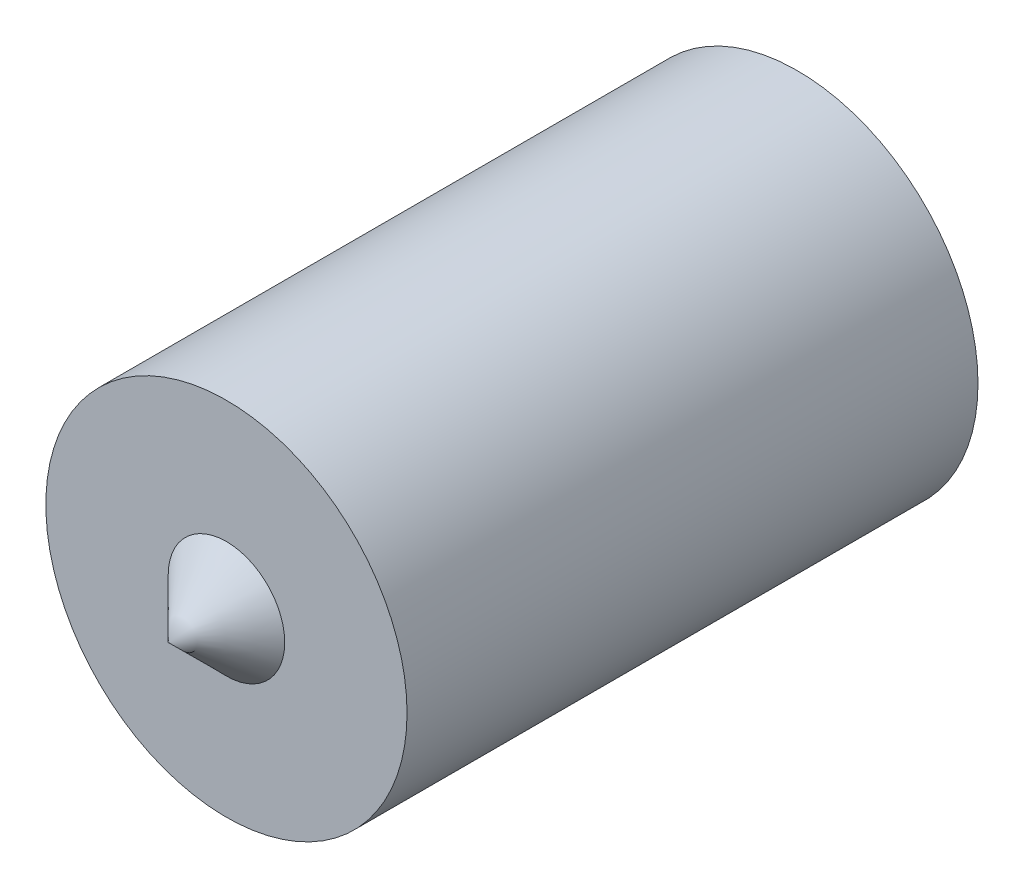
ISO-10303-21;
HEADER;
FILE_DESCRIPTION(('STEP AP214'),'2;1');
FILE_NAME('part.step','',(''),(''),'','','');
FILE_SCHEMA(('AUTOMOTIVE_DESIGN { 1 0 10303 214 1 1 1 1 }'));
ENDSEC;
DATA;
#1=APPLICATION_CONTEXT('core data for automotive mechanical design processes');
#2=APPLICATION_PROTOCOL_DEFINITION('international standard','automotive_design',2000,#1);
#3=PRODUCT_CONTEXT('',#1,'mechanical');
#4=PRODUCT('Part','Part','',(#3));
#5=PRODUCT_RELATED_PRODUCT_CATEGORY('part','',(#4));
#6=PRODUCT_DEFINITION_FORMATION('','',#4);
#7=PRODUCT_DEFINITION_CONTEXT('part definition',#1,'design');
#8=PRODUCT_DEFINITION('design','',#6,#7);
#9=PRODUCT_DEFINITION_SHAPE('','',#8);
#10=(LENGTH_UNIT() NAMED_UNIT(*) SI_UNIT(.MILLI.,.METRE.));
#11=(NAMED_UNIT(*) PLANE_ANGLE_UNIT() SI_UNIT($,.RADIAN.));
#12=(NAMED_UNIT(*) SI_UNIT($,.STERADIAN.) SOLID_ANGLE_UNIT());
#13=UNCERTAINTY_MEASURE_WITH_UNIT(LENGTH_MEASURE(1.E-05),#10,'distance_accuracy_value','');
#14=(GEOMETRIC_REPRESENTATION_CONTEXT(3) GLOBAL_UNCERTAINTY_ASSIGNED_CONTEXT((#13)) GLOBAL_UNIT_ASSIGNED_CONTEXT((#10,
#11,#12)) REPRESENTATION_CONTEXT('',''));
#15=CARTESIAN_POINT('',(0.,0.,0.));
#16=DIRECTION('',(0.,0.,1.));
#17=DIRECTION('',(1.,0.,0.));
#18=AXIS2_PLACEMENT_3D('',#15,#16,#17);
#19=CARTESIAN_POINT('',(0.,0.,-0.635000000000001));
#20=DIRECTION('',(0.,0.,-1.));
#21=DIRECTION('',(-1.,0.,0.));
#22=AXIS2_PLACEMENT_3D('',#19,#20,#21);
#23=CONICAL_SURFACE('',#22,0.634999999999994,0.785398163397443);
#24=CARTESIAN_POINT('',(0.,0.,0.));
#25=VERTEX_POINT('',#24);
#26=VERTEX_LOOP('',#25);
#27=FACE_BOUND('',#26,.T.);
#28=CARTESIAN_POINT('',(0.,0.,-0.635000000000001));
#29=DIRECTION('',(0.,0.,1.));
#30=DIRECTION('',(1.,0.,0.));
#31=AXIS2_PLACEMENT_3D('',#28,#29,#30);
#32=CIRCLE('',#31,0.634999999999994);
#33=CARTESIAN_POINT('',(0.634999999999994,0.,-0.635000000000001));
#34=VERTEX_POINT('',#33);
#35=EDGE_CURVE('E53',#34,#34,#32,.T.);
#36=ORIENTED_EDGE('',*,*,#35,.T.);
#37=EDGE_LOOP('',(#36));
#38=FACE_BOUND('',#37,.T.);
#39=ADVANCED_FACE('F35',(#27,#38),#23,.T.);
#40=CARTESIAN_POINT('',(0.,0.,-1.11545644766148));
#41=DIRECTION('',(0.,0.,-1.));
#42=DIRECTION('',(-1.,0.,0.));
#43=AXIS2_PLACEMENT_3D('',#40,#41,#42);
#44=CONICAL_SURFACE('',#43,0.,1.0471975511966);
#45=CARTESIAN_POINT('',(0.,0.,-2.032));
#46=DIRECTION('',(0.,0.,1.));
#47=DIRECTION('',(1.,0.,0.));
#48=AXIS2_PLACEMENT_3D('',#45,#46,#47);
#49=CIRCLE('',#48,1.5875);
#50=CARTESIAN_POINT('',(1.5875,0.,-2.032));
#51=VERTEX_POINT('',#50);
#52=EDGE_CURVE('E11',#51,#51,#49,.T.);
#53=ORIENTED_EDGE('',*,*,#52,.F.);
#54=EDGE_LOOP('',(#53));
#55=FACE_BOUND('',#54,.T.);
#56=CARTESIAN_POINT('',(0.,0.,-1.11545644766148));
#57=VERTEX_POINT('',#56);
#58=VERTEX_LOOP('',#57);
#59=FACE_BOUND('',#58,.T.);
#60=ADVANCED_FACE('F50',(#55,#59),#44,.F.);
#61=CARTESIAN_POINT('',(0.,0.,0.));
#62=DIRECTION('',(0.,0.,1.));
#63=DIRECTION('',(1.,0.,0.));
#64=AXIS2_PLACEMENT_3D('',#61,#62,#63);
#65=CYLINDRICAL_SURFACE('',#64,1.5875);
#66=CARTESIAN_POINT('',(0.,0.,-6.858));
#67=DIRECTION('',(0.,0.,1.));
#68=DIRECTION('',(1.,0.,0.));
#69=AXIS2_PLACEMENT_3D('',#66,#67,#68);
#70=CIRCLE('',#69,1.5875);
#71=CARTESIAN_POINT('',(1.5875,0.,-6.858));
#72=VERTEX_POINT('',#71);
#73=EDGE_CURVE('E42',#72,#72,#70,.T.);
#74=ORIENTED_EDGE('',*,*,#73,.F.);
#75=EDGE_LOOP('',(#74));
#76=FACE_BOUND('',#75,.T.);
#77=ORIENTED_EDGE('',*,*,#52,.T.);
#78=EDGE_LOOP('',(#77));
#79=FACE_BOUND('',#78,.T.);
#80=ADVANCED_FACE('F67',(#76,#79),#65,.F.);
#81=CARTESIAN_POINT('',(0.,1.5875,-6.858));
#82=DIRECTION('',(0.,0.,1.));
#83=DIRECTION('',(1.,0.,0.));
#84=AXIS2_PLACEMENT_3D('',#81,#82,#83);
#85=PLANE('',#84);
#86=CARTESIAN_POINT('',(0.,0.,-6.858));
#87=DIRECTION('',(0.,0.,1.));
#88=DIRECTION('',(1.,0.,0.));
#89=AXIS2_PLACEMENT_3D('',#86,#87,#88);
#90=CIRCLE('',#89,1.9685);
#91=CARTESIAN_POINT('',(1.9685,0.,-6.858));
#92=VERTEX_POINT('',#91);
#93=EDGE_CURVE('E58',#92,#92,#90,.T.);
#94=ORIENTED_EDGE('',*,*,#93,.F.);
#95=EDGE_LOOP('',(#94));
#96=FACE_BOUND('',#95,.T.);
#97=ORIENTED_EDGE('',*,*,#73,.T.);
#98=EDGE_LOOP('',(#97));
#99=FACE_BOUND('',#98,.T.);
#100=ADVANCED_FACE('F65',(#96,#99),#85,.F.);
#101=CARTESIAN_POINT('',(0.,0.,0.));
#102=DIRECTION('',(0.,0.,1.));
#103=DIRECTION('',(1.,0.,0.));
#104=AXIS2_PLACEMENT_3D('',#101,#102,#103);
#105=CYLINDRICAL_SURFACE('',#104,1.9685);
#106=CARTESIAN_POINT('',(0.,0.,-0.635000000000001));
#107=DIRECTION('',(0.,0.,1.));
#108=DIRECTION('',(1.,0.,0.));
#109=AXIS2_PLACEMENT_3D('',#106,#107,#108);
#110=CIRCLE('',#109,1.9685);
#111=CARTESIAN_POINT('',(1.9685,0.,-0.635000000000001));
#112=VERTEX_POINT('',#111);
#113=EDGE_CURVE('E55',#112,#112,#110,.T.);
#114=ORIENTED_EDGE('',*,*,#113,.F.);
#115=EDGE_LOOP('',(#114));
#116=FACE_BOUND('',#115,.T.);
#117=ORIENTED_EDGE('',*,*,#93,.T.);
#118=EDGE_LOOP('',(#117));
#119=FACE_BOUND('',#118,.T.);
#120=ADVANCED_FACE('F79',(#116,#119),#105,.T.);
#121=CARTESIAN_POINT('',(0.,1.9685,-0.635000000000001));
#122=DIRECTION('',(0.,0.,-1.));
#123=DIRECTION('',(-1.,0.,0.));
#124=AXIS2_PLACEMENT_3D('',#121,#122,#123);
#125=PLANE('',#124);
#126=ORIENTED_EDGE('',*,*,#35,.F.);
#127=EDGE_LOOP('',(#126));
#128=FACE_BOUND('',#127,.T.);
#129=ORIENTED_EDGE('',*,*,#113,.T.);
#130=EDGE_LOOP('',(#129));
#131=FACE_BOUND('',#130,.T.);
#132=ADVANCED_FACE('F83',(#128,#131),#125,.F.);
#133=CLOSED_SHELL('',(#39,#60,#80,#100,#120,#132));
#134=MANIFOLD_SOLID_BREP('B2',#133);
#135=ADVANCED_BREP_SHAPE_REPRESENTATION('',(#18,#134),#14);
#136=SHAPE_DEFINITION_REPRESENTATION(#9,#135);
ENDSEC;
END-ISO-10303-21;
